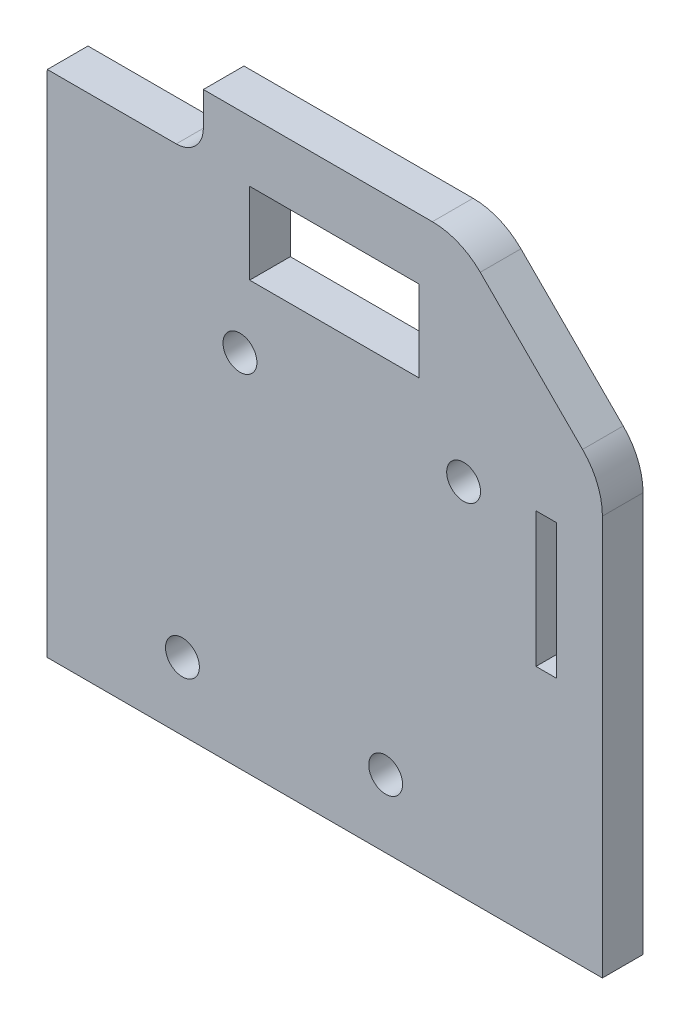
ISO-10303-21;
HEADER;
FILE_DESCRIPTION(('STEP AP214'),'2;1');
FILE_NAME('part.step','',(''),(''),'','','');
FILE_SCHEMA(('AUTOMOTIVE_DESIGN { 1 0 10303 214 1 1 1 1 }'));
ENDSEC;
DATA;
#1=APPLICATION_CONTEXT('core data for automotive mechanical design processes');
#2=APPLICATION_PROTOCOL_DEFINITION('international standard','automotive_design',2000,#1);
#3=PRODUCT_CONTEXT('',#1,'mechanical');
#4=PRODUCT('Part','Part','',(#3));
#5=PRODUCT_RELATED_PRODUCT_CATEGORY('part','',(#4));
#6=PRODUCT_DEFINITION_FORMATION('','',#4);
#7=PRODUCT_DEFINITION_CONTEXT('part definition',#1,'design');
#8=PRODUCT_DEFINITION('design','',#6,#7);
#9=PRODUCT_DEFINITION_SHAPE('','',#8);
#10=(LENGTH_UNIT() NAMED_UNIT(*) SI_UNIT(.MILLI.,.METRE.));
#11=(NAMED_UNIT(*) PLANE_ANGLE_UNIT() SI_UNIT($,.RADIAN.));
#12=(NAMED_UNIT(*) SI_UNIT($,.STERADIAN.) SOLID_ANGLE_UNIT());
#13=UNCERTAINTY_MEASURE_WITH_UNIT(LENGTH_MEASURE(1.E-05),#10,'distance_accuracy_value','');
#14=(GEOMETRIC_REPRESENTATION_CONTEXT(3) GLOBAL_UNCERTAINTY_ASSIGNED_CONTEXT((#13)) GLOBAL_UNIT_ASSIGNED_CONTEXT((#10,
#11,#12)) REPRESENTATION_CONTEXT('',''));
#15=CARTESIAN_POINT('',(0.,0.,0.));
#16=DIRECTION('',(0.,0.,1.));
#17=DIRECTION('',(1.,0.,0.));
#18=AXIS2_PLACEMENT_3D('',#15,#16,#17);
#19=CARTESIAN_POINT('',(-261.973046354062,66.8435005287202,6.));
#20=DIRECTION('',(0.,0.,1.));
#21=DIRECTION('',(1.,0.,0.));
#22=AXIS2_PLACEMENT_3D('',#19,#20,#21);
#23=PLANE('',#22);
#24=DIRECTION('',(0.,1.,0.));
#25=VECTOR('',#24,1.);
#26=CARTESIAN_POINT('',(-248.88538149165,71.884414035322,6.));
#27=LINE('',#26,#25);
#28=CARTESIAN_POINT('',(-248.88538149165,71.884414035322,6.));
#29=VERTEX_POINT('',#28);
#30=CARTESIAN_POINT('',(-248.88538149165,76.8435005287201,6.));
#31=VERTEX_POINT('',#30);
#32=EDGE_CURVE('E47',#29,#31,#27,.T.);
#33=ORIENTED_EDGE('',*,*,#32,.F.);
#34=CARTESIAN_POINT('',(-252.88538149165,71.884414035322,6.));
#35=DIRECTION('',(0.,0.,1.));
#36=DIRECTION('',(1.,0.,0.));
#37=AXIS2_PLACEMENT_3D('',#34,#35,#36);
#38=CIRCLE('',#37,4.);
#39=CARTESIAN_POINT('',(-252.88538149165,67.884414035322,6.));
#40=VERTEX_POINT('',#39);
#41=EDGE_CURVE('E168',#40,#29,#38,.T.);
#42=ORIENTED_EDGE('',*,*,#41,.F.);
#43=DIRECTION('',(1.,0.,0.));
#44=VECTOR('',#43,1.);
#45=CARTESIAN_POINT('',(-271.973035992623,67.884414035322,6.));
#46=LINE('',#45,#44);
#47=CARTESIAN_POINT('',(-271.918723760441,67.884414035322,6.));
#48=VERTEX_POINT('',#47);
#49=EDGE_CURVE('E174',#48,#40,#46,.T.);
#50=ORIENTED_EDGE('',*,*,#49,.F.);
#51=CARTESIAN_POINT('',(-261.973046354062,66.8435005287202,6.));
#52=DIRECTION('',(0.,0.,1.));
#53=DIRECTION('',(1.,0.,0.));
#54=AXIS2_PLACEMENT_3D('',#51,#52,#53);
#55=CIRCLE('',#54,9.99999999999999);
#56=CARTESIAN_POINT('',(-271.97304635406,66.8435061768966,6.));
#57=VERTEX_POINT('',#56);
#58=EDGE_CURVE('E277',#48,#57,#55,.T.);
#59=ORIENTED_EDGE('',*,*,#58,.T.);
#60=DIRECTION('',(-5.64817653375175E-07,-0.999999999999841,0.));
#61=VECTOR('',#60,1.);
#62=CARTESIAN_POINT('',(-271.97304635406,66.8435061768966,6.));
#63=LINE('',#62,#61);
#64=CARTESIAN_POINT('',(-271.973088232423,-7.30141962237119,6.));
#65=VERTEX_POINT('',#64);
#66=EDGE_CURVE('E279',#57,#65,#63,.T.);
#67=ORIENTED_EDGE('',*,*,#66,.T.);
#68=DIRECTION('',(1.,0.,0.));
#69=VECTOR('',#68,1.);
#70=CARTESIAN_POINT('',(-189.97306501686,-7.30141962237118,6.));
#71=LINE('',#70,#69);
#72=CARTESIAN_POINT('',(-189.97306501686,-7.30141962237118,6.));
#73=VERTEX_POINT('',#72);
#74=EDGE_CURVE('E282',#65,#73,#71,.T.);
#75=ORIENTED_EDGE('',*,*,#74,.T.);
#76=DIRECTION('',(0.,1.,0.));
#77=VECTOR('',#76,1.);
#78=CARTESIAN_POINT('',(-189.97306501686,51.7422784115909,6.));
#79=LINE('',#78,#77);
#80=CARTESIAN_POINT('',(-189.97306501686,51.7422784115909,6.));
#81=VERTEX_POINT('',#80);
#82=EDGE_CURVE('E284',#73,#81,#79,.T.);
#83=ORIENTED_EDGE('',*,*,#82,.T.);
#84=CARTESIAN_POINT('',(-199.97306501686,51.7422784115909,6.));
#85=DIRECTION('',(0.,0.,1.));
#86=DIRECTION('',(1.,0.,0.));
#87=AXIS2_PLACEMENT_3D('',#84,#85,#86);
#88=CIRCLE('',#87,10.);
#89=CARTESIAN_POINT('',(-192.901997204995,58.8133462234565,6.));
#90=VERTEX_POINT('',#89);
#91=EDGE_CURVE('E286',#81,#90,#88,.T.);
#92=ORIENTED_EDGE('',*,*,#91,.T.);
#93=DIRECTION('',(-0.707106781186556,0.707106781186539,0.));
#94=VECTOR('',#93,1.);
#95=CARTESIAN_POINT('',(-192.901997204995,58.8133462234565,6.));
#96=LINE('',#95,#94);
#97=CARTESIAN_POINT('',(-208.003219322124,73.9145683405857,6.));
#98=VERTEX_POINT('',#97);
#99=EDGE_CURVE('E288',#90,#98,#96,.T.);
#100=ORIENTED_EDGE('',*,*,#99,.T.);
#101=CARTESIAN_POINT('',(-215.07428713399,66.8435005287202,6.));
#102=DIRECTION('',(0.,0.,1.));
#103=DIRECTION('',(1.,0.,0.));
#104=AXIS2_PLACEMENT_3D('',#101,#102,#103);
#105=CIRCLE('',#104,9.99999999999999);
#106=CARTESIAN_POINT('',(-215.07428713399,76.8435005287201,6.));
#107=VERTEX_POINT('',#106);
#108=EDGE_CURVE('E290',#98,#107,#105,.T.);
#109=ORIENTED_EDGE('',*,*,#108,.T.);
#110=DIRECTION('',(-1.,0.,0.));
#111=VECTOR('',#110,1.);
#112=CARTESIAN_POINT('',(-261.973046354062,76.8435005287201,6.));
#113=LINE('',#112,#111);
#114=EDGE_CURVE('E292',#107,#31,#113,.T.);
#115=ORIENTED_EDGE('',*,*,#114,.T.);
#116=EDGE_LOOP('',(#33,#42,#50,#59,#67,#75,#83,#92,#100,#109,#115));
#117=FACE_BOUND('',#116,.T.);
#118=DIRECTION('',(0.,1.,0.));
#119=VECTOR('',#118,1.);
#120=CARTESIAN_POINT('',(-199.780083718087,27.6308045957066,6.));
#121=LINE('',#120,#119);
#122=CARTESIAN_POINT('',(-199.780083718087,27.6308045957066,6.));
#123=VERTEX_POINT('',#122);
#124=CARTESIAN_POINT('',(-199.780083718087,47.5294663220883,6.));
#125=VERTEX_POINT('',#124);
#126=EDGE_CURVE('E192',#123,#125,#121,.T.);
#127=ORIENTED_EDGE('',*,*,#126,.T.);
#128=DIRECTION('',(1.,0.,0.));
#129=VECTOR('',#128,1.);
#130=CARTESIAN_POINT('',(-196.780083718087,47.5294663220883,6.));
#131=LINE('',#130,#129);
#132=CARTESIAN_POINT('',(-196.780083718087,47.5294663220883,6.));
#133=VERTEX_POINT('',#132);
#134=EDGE_CURVE('E195',#125,#133,#131,.T.);
#135=ORIENTED_EDGE('',*,*,#134,.T.);
#136=DIRECTION('',(0.,-1.,0.));
#137=VECTOR('',#136,1.);
#138=CARTESIAN_POINT('',(-196.780083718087,27.6308045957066,6.));
#139=LINE('',#138,#137);
#140=CARTESIAN_POINT('',(-196.780083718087,27.6308045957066,6.));
#141=VERTEX_POINT('',#140);
#142=EDGE_CURVE('E55',#133,#141,#139,.T.);
#143=ORIENTED_EDGE('',*,*,#142,.T.);
#144=DIRECTION('',(-1.,0.,0.));
#145=VECTOR('',#144,1.);
#146=CARTESIAN_POINT('',(-196.780083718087,27.6308045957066,6.));
#147=LINE('',#146,#145);
#148=EDGE_CURVE('E200',#141,#123,#147,.T.);
#149=ORIENTED_EDGE('',*,*,#148,.T.);
#150=EDGE_LOOP('',(#127,#135,#143,#149));
#151=FACE_BOUND('',#150,.T.);
#152=CARTESIAN_POINT('',(-243.482374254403,45.8964952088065,6.));
#153=DIRECTION('',(0.,0.,1.));
#154=DIRECTION('',(1.,0.,0.));
#155=AXIS2_PLACEMENT_3D('',#152,#153,#154);
#156=CIRCLE('',#155,2.49999999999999);
#157=CARTESIAN_POINT('',(-240.982374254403,45.8964952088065,6.));
#158=VERTEX_POINT('',#157);
#159=EDGE_CURVE('E228',#158,#158,#156,.T.);
#160=ORIENTED_EDGE('',*,*,#159,.F.);
#161=EDGE_LOOP('',(#160));
#162=FACE_BOUND('',#161,.T.);
#163=CARTESIAN_POINT('',(-251.97306501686,2.69858037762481,6.));
#164=DIRECTION('',(0.,0.,1.));
#165=DIRECTION('',(1.,0.,0.));
#166=AXIS2_PLACEMENT_3D('',#163,#164,#165);
#167=CIRCLE('',#166,2.49999999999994);
#168=CARTESIAN_POINT('',(-249.473065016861,2.69858037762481,6.));
#169=VERTEX_POINT('',#168);
#170=EDGE_CURVE('E240',#169,#169,#167,.T.);
#171=ORIENTED_EDGE('',*,*,#170,.F.);
#172=EDGE_LOOP('',(#171));
#173=FACE_BOUND('',#172,.T.);
#174=DIRECTION('',(1.,0.,0.));
#175=VECTOR('',#174,1.);
#176=CARTESIAN_POINT('',(-217.046614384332,55.8844140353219,6.));
#177=LINE('',#176,#175);
#178=CARTESIAN_POINT('',(-242.046605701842,55.8844140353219,6.));
#179=VERTEX_POINT('',#178);
#180=CARTESIAN_POINT('',(-217.046614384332,55.8844140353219,6.));
#181=VERTEX_POINT('',#180);
#182=EDGE_CURVE('E248',#179,#181,#177,.T.);
#183=ORIENTED_EDGE('',*,*,#182,.F.);
#184=DIRECTION('',(0.,-1.,0.));
#185=VECTOR('',#184,1.);
#186=CARTESIAN_POINT('',(-242.046605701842,55.8844140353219,6.));
#187=LINE('',#186,#185);
#188=CARTESIAN_POINT('',(-242.046605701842,67.8844140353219,6.));
#189=VERTEX_POINT('',#188);
#190=EDGE_CURVE('E246',#189,#179,#187,.T.);
#191=ORIENTED_EDGE('',*,*,#190,.F.);
#192=DIRECTION('',(-1.,0.,0.));
#193=VECTOR('',#192,1.);
#194=CARTESIAN_POINT('',(-242.046605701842,67.8844140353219,6.));
#195=LINE('',#194,#193);
#196=CARTESIAN_POINT('',(-217.046614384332,67.8844140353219,6.));
#197=VERTEX_POINT('',#196);
#198=EDGE_CURVE('E254',#197,#189,#195,.T.);
#199=ORIENTED_EDGE('',*,*,#198,.F.);
#200=DIRECTION('',(0.,1.,0.));
#201=VECTOR('',#200,1.);
#202=CARTESIAN_POINT('',(-217.046614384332,67.8844140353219,6.));
#203=LINE('',#202,#201);
#204=EDGE_CURVE('E251',#181,#197,#203,.T.);
#205=ORIENTED_EDGE('',*,*,#204,.F.);
#206=EDGE_LOOP('',(#183,#191,#199,#205));
#207=FACE_BOUND('',#206,.T.);
#208=CARTESIAN_POINT('',(-221.971337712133,2.69858037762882,6.));
#209=DIRECTION('',(0.,0.,1.));
#210=DIRECTION('',(1.,0.,0.));
#211=AXIS2_PLACEMENT_3D('',#208,#209,#210);
#212=CIRCLE('',#211,2.49824947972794);
#213=CARTESIAN_POINT('',(-219.473088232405,2.69858037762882,6.));
#214=VERTEX_POINT('',#213);
#215=EDGE_CURVE('E234',#214,#214,#212,.T.);
#216=ORIENTED_EDGE('',*,*,#215,.F.);
#217=EDGE_LOOP('',(#216));
#218=FACE_BOUND('',#217,.T.);
#219=CARTESIAN_POINT('',(-210.463802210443,45.8964952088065,6.));
#220=DIRECTION('',(0.,0.,1.));
#221=DIRECTION('',(1.,0.,0.));
#222=AXIS2_PLACEMENT_3D('',#219,#220,#221);
#223=CIRCLE('',#222,2.5);
#224=CARTESIAN_POINT('',(-207.963802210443,45.8964952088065,6.));
#225=VERTEX_POINT('',#224);
#226=EDGE_CURVE('E222',#225,#225,#223,.T.);
#227=ORIENTED_EDGE('',*,*,#226,.F.);
#228=EDGE_LOOP('',(#227));
#229=FACE_BOUND('',#228,.T.);
#230=ADVANCED_FACE('F32',(#117,#151,#162,#173,#207,#218,#229),#23,.T.);
#231=CARTESIAN_POINT('',(-261.973046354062,66.8435005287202,0.));
#232=DIRECTION('',(0.,0.,1.));
#233=DIRECTION('',(1.,0.,0.));
#234=AXIS2_PLACEMENT_3D('',#231,#232,#233);
#235=PLANE('',#234);
#236=DIRECTION('',(1.,0.,0.));
#237=VECTOR('',#236,1.);
#238=CARTESIAN_POINT('',(-196.780083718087,47.5294663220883,0.));
#239=LINE('',#238,#237);
#240=CARTESIAN_POINT('',(-199.780083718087,47.5294663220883,0.));
#241=VERTEX_POINT('',#240);
#242=CARTESIAN_POINT('',(-196.780083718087,47.5294663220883,0.));
#243=VERTEX_POINT('',#242);
#244=EDGE_CURVE('E205',#241,#243,#239,.T.);
#245=ORIENTED_EDGE('',*,*,#244,.F.);
#246=DIRECTION('',(0.,1.,0.));
#247=VECTOR('',#246,1.);
#248=CARTESIAN_POINT('',(-199.780083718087,27.6308045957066,0.));
#249=LINE('',#248,#247);
#250=CARTESIAN_POINT('',(-199.780083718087,27.6308045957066,0.));
#251=VERTEX_POINT('',#250);
#252=EDGE_CURVE('E191',#251,#241,#249,.T.);
#253=ORIENTED_EDGE('',*,*,#252,.F.);
#254=DIRECTION('',(-1.,0.,0.));
#255=VECTOR('',#254,1.);
#256=CARTESIAN_POINT('',(-196.780083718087,27.6308045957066,0.));
#257=LINE('',#256,#255);
#258=CARTESIAN_POINT('',(-196.780083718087,27.6308045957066,0.));
#259=VERTEX_POINT('',#258);
#260=EDGE_CURVE('E196',#259,#251,#257,.T.);
#261=ORIENTED_EDGE('',*,*,#260,.F.);
#262=DIRECTION('',(0.,-1.,0.));
#263=VECTOR('',#262,1.);
#264=CARTESIAN_POINT('',(-196.780083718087,27.6308045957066,0.));
#265=LINE('',#264,#263);
#266=EDGE_CURVE('E208',#243,#259,#265,.T.);
#267=ORIENTED_EDGE('',*,*,#266,.F.);
#268=EDGE_LOOP('',(#245,#253,#261,#267));
#269=FACE_BOUND('',#268,.T.);
#270=CARTESIAN_POINT('',(-243.482374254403,45.8964952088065,0.));
#271=DIRECTION('',(0.,0.,1.));
#272=DIRECTION('',(1.,0.,0.));
#273=AXIS2_PLACEMENT_3D('',#270,#271,#272);
#274=CIRCLE('',#273,2.49999999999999);
#275=CARTESIAN_POINT('',(-240.982374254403,45.8964952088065,0.));
#276=VERTEX_POINT('',#275);
#277=EDGE_CURVE('E225',#276,#276,#274,.T.);
#278=ORIENTED_EDGE('',*,*,#277,.T.);
#279=EDGE_LOOP('',(#278));
#280=FACE_BOUND('',#279,.T.);
#281=CARTESIAN_POINT('',(-251.97306501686,2.69858037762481,0.));
#282=DIRECTION('',(0.,0.,1.));
#283=DIRECTION('',(1.,0.,0.));
#284=AXIS2_PLACEMENT_3D('',#281,#282,#283);
#285=CIRCLE('',#284,2.49999999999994);
#286=CARTESIAN_POINT('',(-249.473065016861,2.69858037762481,0.));
#287=VERTEX_POINT('',#286);
#288=EDGE_CURVE('E237',#287,#287,#285,.T.);
#289=ORIENTED_EDGE('',*,*,#288,.T.);
#290=EDGE_LOOP('',(#289));
#291=FACE_BOUND('',#290,.T.);
#292=CARTESIAN_POINT('',(-252.88538149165,71.884414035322,0.));
#293=DIRECTION('',(0.,0.,1.));
#294=DIRECTION('',(1.,0.,0.));
#295=AXIS2_PLACEMENT_3D('',#292,#293,#294);
#296=CIRCLE('',#295,4.);
#297=CARTESIAN_POINT('',(-252.88538149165,67.884414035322,0.));
#298=VERTEX_POINT('',#297);
#299=CARTESIAN_POINT('',(-248.88538149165,71.884414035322,0.));
#300=VERTEX_POINT('',#299);
#301=EDGE_CURVE('E11',#298,#300,#296,.T.);
#302=ORIENTED_EDGE('',*,*,#301,.T.);
#303=DIRECTION('',(0.,1.,0.));
#304=VECTOR('',#303,1.);
#305=CARTESIAN_POINT('',(-248.88538149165,66.8435005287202,0.));
#306=LINE('',#305,#304);
#307=CARTESIAN_POINT('',(-248.88538149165,76.8435005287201,0.));
#308=VERTEX_POINT('',#307);
#309=EDGE_CURVE('E185',#300,#308,#306,.T.);
#310=ORIENTED_EDGE('',*,*,#309,.T.);
#311=DIRECTION('',(-1.,0.,0.));
#312=VECTOR('',#311,1.);
#313=CARTESIAN_POINT('',(-261.973046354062,76.8435005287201,0.));
#314=LINE('',#313,#312);
#315=CARTESIAN_POINT('',(-215.07428713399,76.8435005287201,0.));
#316=VERTEX_POINT('',#315);
#317=EDGE_CURVE('E280',#316,#308,#314,.T.);
#318=ORIENTED_EDGE('',*,*,#317,.F.);
#319=CARTESIAN_POINT('',(-215.07428713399,66.8435005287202,0.));
#320=DIRECTION('',(0.,0.,1.));
#321=DIRECTION('',(1.,0.,0.));
#322=AXIS2_PLACEMENT_3D('',#319,#320,#321);
#323=CIRCLE('',#322,9.99999999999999);
#324=CARTESIAN_POINT('',(-208.003219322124,73.9145683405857,0.));
#325=VERTEX_POINT('',#324);
#326=EDGE_CURVE('E306',#325,#316,#323,.T.);
#327=ORIENTED_EDGE('',*,*,#326,.F.);
#328=DIRECTION('',(-0.707106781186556,0.707106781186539,0.));
#329=VECTOR('',#328,1.);
#330=CARTESIAN_POINT('',(-192.901997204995,58.8133462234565,0.));
#331=LINE('',#330,#329);
#332=CARTESIAN_POINT('',(-192.901997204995,58.8133462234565,0.));
#333=VERTEX_POINT('',#332);
#334=EDGE_CURVE('E304',#333,#325,#331,.T.);
#335=ORIENTED_EDGE('',*,*,#334,.F.);
#336=CARTESIAN_POINT('',(-199.97306501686,51.7422784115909,0.));
#337=DIRECTION('',(0.,0.,1.));
#338=DIRECTION('',(1.,0.,0.));
#339=AXIS2_PLACEMENT_3D('',#336,#337,#338);
#340=CIRCLE('',#339,10.);
#341=CARTESIAN_POINT('',(-189.97306501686,51.7422784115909,0.));
#342=VERTEX_POINT('',#341);
#343=EDGE_CURVE('E302',#342,#333,#340,.T.);
#344=ORIENTED_EDGE('',*,*,#343,.F.);
#345=DIRECTION('',(0.,1.,0.));
#346=VECTOR('',#345,1.);
#347=CARTESIAN_POINT('',(-189.97306501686,51.7422784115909,0.));
#348=LINE('',#347,#346);
#349=CARTESIAN_POINT('',(-189.97306501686,-7.30141962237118,0.));
#350=VERTEX_POINT('',#349);
#351=EDGE_CURVE('E300',#350,#342,#348,.T.);
#352=ORIENTED_EDGE('',*,*,#351,.F.);
#353=DIRECTION('',(1.,0.,0.));
#354=VECTOR('',#353,1.);
#355=CARTESIAN_POINT('',(-189.97306501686,-7.30141962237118,0.));
#356=LINE('',#355,#354);
#357=CARTESIAN_POINT('',(-271.973088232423,-7.30141962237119,0.));
#358=VERTEX_POINT('',#357);
#359=EDGE_CURVE('E298',#358,#350,#356,.T.);
#360=ORIENTED_EDGE('',*,*,#359,.F.);
#361=DIRECTION('',(-5.64817653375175E-07,-0.999999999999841,0.));
#362=VECTOR('',#361,1.);
#363=CARTESIAN_POINT('',(-271.97304635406,66.8435061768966,0.));
#364=LINE('',#363,#362);
#365=CARTESIAN_POINT('',(-271.97304635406,66.8435061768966,0.));
#366=VERTEX_POINT('',#365);
#367=EDGE_CURVE('E296',#366,#358,#364,.T.);
#368=ORIENTED_EDGE('',*,*,#367,.F.);
#369=CARTESIAN_POINT('',(-261.973046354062,66.8435005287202,0.));
#370=DIRECTION('',(0.,0.,1.));
#371=DIRECTION('',(1.,0.,0.));
#372=AXIS2_PLACEMENT_3D('',#369,#370,#371);
#373=CIRCLE('',#372,9.99999999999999);
#374=CARTESIAN_POINT('',(-271.918723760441,67.884414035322,0.));
#375=VERTEX_POINT('',#374);
#376=EDGE_CURVE('E276',#375,#366,#373,.T.);
#377=ORIENTED_EDGE('',*,*,#376,.F.);
#378=DIRECTION('',(1.,0.,0.));
#379=VECTOR('',#378,1.);
#380=CARTESIAN_POINT('',(-261.973046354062,67.884414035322,0.));
#381=LINE('',#380,#379);
#382=EDGE_CURVE('E189',#375,#298,#381,.T.);
#383=ORIENTED_EDGE('',*,*,#382,.T.);
#384=EDGE_LOOP('',(#302,#310,#318,#327,#335,#344,#352,#360,#368,#377,#383));
#385=FACE_BOUND('',#384,.T.);
#386=DIRECTION('',(0.,-1.,0.));
#387=VECTOR('',#386,1.);
#388=CARTESIAN_POINT('',(-242.046605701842,55.8844140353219,0.));
#389=LINE('',#388,#387);
#390=CARTESIAN_POINT('',(-242.046605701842,67.8844140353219,0.));
#391=VERTEX_POINT('',#390);
#392=CARTESIAN_POINT('',(-242.046605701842,55.8844140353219,0.));
#393=VERTEX_POINT('',#392);
#394=EDGE_CURVE('E243',#391,#393,#389,.T.);
#395=ORIENTED_EDGE('',*,*,#394,.T.);
#396=DIRECTION('',(1.,0.,0.));
#397=VECTOR('',#396,1.);
#398=CARTESIAN_POINT('',(-217.046614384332,55.8844140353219,0.));
#399=LINE('',#398,#397);
#400=CARTESIAN_POINT('',(-217.046614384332,55.8844140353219,0.));
#401=VERTEX_POINT('',#400);
#402=EDGE_CURVE('E259',#393,#401,#399,.T.);
#403=ORIENTED_EDGE('',*,*,#402,.T.);
#404=DIRECTION('',(0.,1.,0.));
#405=VECTOR('',#404,1.);
#406=CARTESIAN_POINT('',(-217.046614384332,67.8844140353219,0.));
#407=LINE('',#406,#405);
#408=CARTESIAN_POINT('',(-217.046614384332,67.8844140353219,0.));
#409=VERTEX_POINT('',#408);
#410=EDGE_CURVE('E262',#401,#409,#407,.T.);
#411=ORIENTED_EDGE('',*,*,#410,.T.);
#412=DIRECTION('',(-1.,0.,0.));
#413=VECTOR('',#412,1.);
#414=CARTESIAN_POINT('',(-242.046605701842,67.8844140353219,0.));
#415=LINE('',#414,#413);
#416=EDGE_CURVE('E249',#409,#391,#415,.T.);
#417=ORIENTED_EDGE('',*,*,#416,.T.);
#418=EDGE_LOOP('',(#395,#403,#411,#417));
#419=FACE_BOUND('',#418,.T.);
#420=CARTESIAN_POINT('',(-221.971337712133,2.69858037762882,0.));
#421=DIRECTION('',(0.,0.,1.));
#422=DIRECTION('',(1.,0.,0.));
#423=AXIS2_PLACEMENT_3D('',#420,#421,#422);
#424=CIRCLE('',#423,2.49824947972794);
#425=CARTESIAN_POINT('',(-219.473088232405,2.69858037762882,0.));
#426=VERTEX_POINT('',#425);
#427=EDGE_CURVE('E231',#426,#426,#424,.T.);
#428=ORIENTED_EDGE('',*,*,#427,.T.);
#429=EDGE_LOOP('',(#428));
#430=FACE_BOUND('',#429,.T.);
#431=CARTESIAN_POINT('',(-210.463802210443,45.8964952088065,0.));
#432=DIRECTION('',(0.,0.,1.));
#433=DIRECTION('',(1.,0.,0.));
#434=AXIS2_PLACEMENT_3D('',#431,#432,#433);
#435=CIRCLE('',#434,2.5);
#436=CARTESIAN_POINT('',(-207.963802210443,45.8964952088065,0.));
#437=VERTEX_POINT('',#436);
#438=EDGE_CURVE('E215',#437,#437,#435,.T.);
#439=ORIENTED_EDGE('',*,*,#438,.T.);
#440=EDGE_LOOP('',(#439));
#441=FACE_BOUND('',#440,.T.);
#442=ADVANCED_FACE('F336',(#269,#280,#291,#385,#419,#430,#441),#235,.F.);
#443=CARTESIAN_POINT('',(-261.973046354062,66.8435005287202,6.));
#444=DIRECTION('',(0.,0.,-1.));
#445=DIRECTION('',(-1.,0.,0.));
#446=AXIS2_PLACEMENT_3D('',#443,#444,#445);
#447=CYLINDRICAL_SURFACE('',#446,9.99999999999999);
#448=ORIENTED_EDGE('',*,*,#58,.F.);
#449=DIRECTION('',(0.,0.,-1.));
#450=VECTOR('',#449,1.);
#451=CARTESIAN_POINT('',(-271.918723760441,67.884414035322,6.));
#452=LINE('',#451,#450);
#453=EDGE_CURVE('E40',#48,#375,#452,.T.);
#454=ORIENTED_EDGE('',*,*,#453,.T.);
#455=ORIENTED_EDGE('',*,*,#376,.T.);
#456=DIRECTION('',(0.,0.,-1.));
#457=VECTOR('',#456,1.);
#458=CARTESIAN_POINT('',(-271.97304635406,66.8435061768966,6.));
#459=LINE('',#458,#457);
#460=EDGE_CURVE('E327',#57,#366,#459,.T.);
#461=ORIENTED_EDGE('',*,*,#460,.F.);
#462=EDGE_LOOP('',(#448,#454,#455,#461));
#463=FACE_BOUND('',#462,.T.);
#464=ADVANCED_FACE('F34',(#463),#447,.T.);
#465=CARTESIAN_POINT('',(-271.97304635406,66.8435061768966,6.));
#466=DIRECTION('',(0.99999999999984,-5.64817653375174E-07,0.));
#467=DIRECTION('',(5.64817653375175E-07,0.999999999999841,0.));
#468=AXIS2_PLACEMENT_3D('',#465,#466,#467);
#469=PLANE('',#468);
#470=ORIENTED_EDGE('',*,*,#367,.T.);
#471=DIRECTION('',(0.,0.,-1.));
#472=VECTOR('',#471,1.);
#473=CARTESIAN_POINT('',(-271.973088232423,-7.30141962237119,6.));
#474=LINE('',#473,#472);
#475=EDGE_CURVE('E324',#65,#358,#474,.T.);
#476=ORIENTED_EDGE('',*,*,#475,.F.);
#477=ORIENTED_EDGE('',*,*,#66,.F.);
#478=ORIENTED_EDGE('',*,*,#460,.T.);
#479=EDGE_LOOP('',(#470,#476,#477,#478));
#480=FACE_BOUND('',#479,.T.);
#481=ADVANCED_FACE('F343',(#480),#469,.F.);
#482=CARTESIAN_POINT('',(-189.97306501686,-7.30141962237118,6.));
#483=DIRECTION('',(0.,1.,0.));
#484=DIRECTION('',(-1.,0.,0.));
#485=AXIS2_PLACEMENT_3D('',#482,#483,#484);
#486=PLANE('',#485);
#487=ORIENTED_EDGE('',*,*,#359,.T.);
#488=DIRECTION('',(0.,0.,-1.));
#489=VECTOR('',#488,1.);
#490=CARTESIAN_POINT('',(-189.97306501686,-7.30141962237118,6.));
#491=LINE('',#490,#489);
#492=EDGE_CURVE('E321',#73,#350,#491,.T.);
#493=ORIENTED_EDGE('',*,*,#492,.F.);
#494=ORIENTED_EDGE('',*,*,#74,.F.);
#495=ORIENTED_EDGE('',*,*,#475,.T.);
#496=EDGE_LOOP('',(#487,#493,#494,#495));
#497=FACE_BOUND('',#496,.T.);
#498=ADVANCED_FACE('F349',(#497),#486,.F.);
#499=CARTESIAN_POINT('',(-189.97306501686,51.7422784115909,6.));
#500=DIRECTION('',(-1.,0.,0.));
#501=DIRECTION('',(0.,-1.,0.));
#502=AXIS2_PLACEMENT_3D('',#499,#500,#501);
#503=PLANE('',#502);
#504=ORIENTED_EDGE('',*,*,#351,.T.);
#505=DIRECTION('',(0.,0.,-1.));
#506=VECTOR('',#505,1.);
#507=CARTESIAN_POINT('',(-189.97306501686,51.7422784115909,6.));
#508=LINE('',#507,#506);
#509=EDGE_CURVE('E318',#81,#342,#508,.T.);
#510=ORIENTED_EDGE('',*,*,#509,.F.);
#511=ORIENTED_EDGE('',*,*,#82,.F.);
#512=ORIENTED_EDGE('',*,*,#492,.T.);
#513=EDGE_LOOP('',(#504,#510,#511,#512));
#514=FACE_BOUND('',#513,.T.);
#515=ADVANCED_FACE('F351',(#514),#503,.F.);
#516=CARTESIAN_POINT('',(-199.97306501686,51.7422784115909,6.));
#517=DIRECTION('',(0.,0.,-1.));
#518=DIRECTION('',(-1.,0.,0.));
#519=AXIS2_PLACEMENT_3D('',#516,#517,#518);
#520=CYLINDRICAL_SURFACE('',#519,10.);
#521=ORIENTED_EDGE('',*,*,#343,.T.);
#522=DIRECTION('',(0.,0.,-1.));
#523=VECTOR('',#522,1.);
#524=CARTESIAN_POINT('',(-192.901997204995,58.8133462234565,6.));
#525=LINE('',#524,#523);
#526=EDGE_CURVE('E315',#90,#333,#525,.T.);
#527=ORIENTED_EDGE('',*,*,#526,.F.);
#528=ORIENTED_EDGE('',*,*,#91,.F.);
#529=ORIENTED_EDGE('',*,*,#509,.T.);
#530=EDGE_LOOP('',(#521,#527,#528,#529));
#531=FACE_BOUND('',#530,.T.);
#532=ADVANCED_FACE('F356',(#531),#520,.T.);
#533=CARTESIAN_POINT('',(-192.901997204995,58.8133462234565,6.));
#534=DIRECTION('',(-0.707106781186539,-0.707106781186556,0.));
#535=DIRECTION('',(0.707106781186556,-0.707106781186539,0.));
#536=AXIS2_PLACEMENT_3D('',#533,#534,#535);
#537=PLANE('',#536);
#538=ORIENTED_EDGE('',*,*,#334,.T.);
#539=DIRECTION('',(0.,0.,-1.));
#540=VECTOR('',#539,1.);
#541=CARTESIAN_POINT('',(-208.003219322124,73.9145683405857,6.));
#542=LINE('',#541,#540);
#543=EDGE_CURVE('E312',#98,#325,#542,.T.);
#544=ORIENTED_EDGE('',*,*,#543,.F.);
#545=ORIENTED_EDGE('',*,*,#99,.F.);
#546=ORIENTED_EDGE('',*,*,#526,.T.);
#547=EDGE_LOOP('',(#538,#544,#545,#546));
#548=FACE_BOUND('',#547,.T.);
#549=ADVANCED_FACE('F362',(#548),#537,.F.);
#550=CARTESIAN_POINT('',(-215.07428713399,66.8435005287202,6.));
#551=DIRECTION('',(0.,0.,-1.));
#552=DIRECTION('',(-1.,0.,0.));
#553=AXIS2_PLACEMENT_3D('',#550,#551,#552);
#554=CYLINDRICAL_SURFACE('',#553,9.99999999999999);
#555=ORIENTED_EDGE('',*,*,#326,.T.);
#556=DIRECTION('',(0.,0.,-1.));
#557=VECTOR('',#556,1.);
#558=CARTESIAN_POINT('',(-215.07428713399,76.8435005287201,6.));
#559=LINE('',#558,#557);
#560=EDGE_CURVE('E294',#107,#316,#559,.T.);
#561=ORIENTED_EDGE('',*,*,#560,.F.);
#562=ORIENTED_EDGE('',*,*,#108,.F.);
#563=ORIENTED_EDGE('',*,*,#543,.T.);
#564=EDGE_LOOP('',(#555,#561,#562,#563));
#565=FACE_BOUND('',#564,.T.);
#566=ADVANCED_FACE('F366',(#565),#554,.T.);
#567=CARTESIAN_POINT('',(-261.973046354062,76.8435005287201,6.));
#568=DIRECTION('',(0.,-1.,0.));
#569=DIRECTION('',(0.,0.,-1.));
#570=AXIS2_PLACEMENT_3D('',#567,#568,#569);
#571=PLANE('',#570);
#572=ORIENTED_EDGE('',*,*,#317,.T.);
#573=DIRECTION('',(0.,0.,1.));
#574=VECTOR('',#573,1.);
#575=CARTESIAN_POINT('',(-248.88538149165,76.8435005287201,6.));
#576=LINE('',#575,#574);
#577=EDGE_CURVE('E330',#308,#31,#576,.T.);
#578=ORIENTED_EDGE('',*,*,#577,.T.);
#579=ORIENTED_EDGE('',*,*,#114,.F.);
#580=ORIENTED_EDGE('',*,*,#560,.T.);
#581=EDGE_LOOP('',(#572,#578,#579,#580));
#582=FACE_BOUND('',#581,.T.);
#583=ADVANCED_FACE('F370',(#582),#571,.F.);
#584=CARTESIAN_POINT('',(-242.046605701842,55.8844140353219,6.));
#585=DIRECTION('',(1.,0.,0.));
#586=DIRECTION('',(0.,0.,-1.));
#587=AXIS2_PLACEMENT_3D('',#584,#585,#586);
#588=PLANE('',#587);
#589=ORIENTED_EDGE('',*,*,#394,.F.);
#590=DIRECTION('',(0.,0.,-1.));
#591=VECTOR('',#590,1.);
#592=CARTESIAN_POINT('',(-242.046605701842,67.8844140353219,6.));
#593=LINE('',#592,#591);
#594=EDGE_CURVE('E256',#189,#391,#593,.T.);
#595=ORIENTED_EDGE('',*,*,#594,.F.);
#596=ORIENTED_EDGE('',*,*,#190,.T.);
#597=DIRECTION('',(0.,0.,-1.));
#598=VECTOR('',#597,1.);
#599=CARTESIAN_POINT('',(-242.046605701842,55.8844140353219,6.));
#600=LINE('',#599,#598);
#601=EDGE_CURVE('E273',#179,#393,#600,.T.);
#602=ORIENTED_EDGE('',*,*,#601,.T.);
#603=EDGE_LOOP('',(#589,#595,#596,#602));
#604=FACE_BOUND('',#603,.T.);
#605=ADVANCED_FACE('F387',(#604),#588,.T.);
#606=CARTESIAN_POINT('',(-217.046614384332,55.8844140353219,6.));
#607=DIRECTION('',(0.,1.,0.));
#608=DIRECTION('',(0.,0.,1.));
#609=AXIS2_PLACEMENT_3D('',#606,#607,#608);
#610=PLANE('',#609);
#611=ORIENTED_EDGE('',*,*,#402,.F.);
#612=ORIENTED_EDGE('',*,*,#601,.F.);
#613=ORIENTED_EDGE('',*,*,#182,.T.);
#614=DIRECTION('',(0.,0.,-1.));
#615=VECTOR('',#614,1.);
#616=CARTESIAN_POINT('',(-217.046614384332,55.8844140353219,6.));
#617=LINE('',#616,#615);
#618=EDGE_CURVE('E271',#181,#401,#617,.T.);
#619=ORIENTED_EDGE('',*,*,#618,.T.);
#620=EDGE_LOOP('',(#611,#612,#613,#619));
#621=FACE_BOUND('',#620,.T.);
#622=ADVANCED_FACE('F517',(#621),#610,.T.);
#623=CARTESIAN_POINT('',(-217.046614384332,67.8844140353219,6.));
#624=DIRECTION('',(-1.,0.,0.));
#625=DIRECTION('',(0.,0.,1.));
#626=AXIS2_PLACEMENT_3D('',#623,#624,#625);
#627=PLANE('',#626);
#628=ORIENTED_EDGE('',*,*,#410,.F.);
#629=ORIENTED_EDGE('',*,*,#618,.F.);
#630=ORIENTED_EDGE('',*,*,#204,.T.);
#631=DIRECTION('',(0.,0.,-1.));
#632=VECTOR('',#631,1.);
#633=CARTESIAN_POINT('',(-217.046614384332,67.8844140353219,6.));
#634=LINE('',#633,#632);
#635=EDGE_CURVE('E269',#197,#409,#634,.T.);
#636=ORIENTED_EDGE('',*,*,#635,.T.);
#637=EDGE_LOOP('',(#628,#629,#630,#636));
#638=FACE_BOUND('',#637,.T.);
#639=ADVANCED_FACE('F507',(#638),#627,.T.);
#640=CARTESIAN_POINT('',(-242.046605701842,67.8844140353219,6.));
#641=DIRECTION('',(0.,-1.,0.));
#642=DIRECTION('',(0.,0.,-1.));
#643=AXIS2_PLACEMENT_3D('',#640,#641,#642);
#644=PLANE('',#643);
#645=ORIENTED_EDGE('',*,*,#416,.F.);
#646=ORIENTED_EDGE('',*,*,#635,.F.);
#647=ORIENTED_EDGE('',*,*,#198,.T.);
#648=ORIENTED_EDGE('',*,*,#594,.T.);
#649=EDGE_LOOP('',(#645,#646,#647,#648));
#650=FACE_BOUND('',#649,.T.);
#651=ADVANCED_FACE('F497',(#650),#644,.T.);
#652=CARTESIAN_POINT('',(-251.97306501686,2.69858037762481,6.));
#653=DIRECTION('',(0.,0.,-1.));
#654=DIRECTION('',(-1.,0.,0.));
#655=AXIS2_PLACEMENT_3D('',#652,#653,#654);
#656=CYLINDRICAL_SURFACE('',#655,2.49999999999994);
#657=ORIENTED_EDGE('',*,*,#170,.T.);
#658=EDGE_LOOP('',(#657));
#659=FACE_BOUND('',#658,.T.);
#660=ORIENTED_EDGE('',*,*,#288,.F.);
#661=EDGE_LOOP('',(#660));
#662=FACE_BOUND('',#661,.T.);
#663=ADVANCED_FACE('F487',(#659,#662),#656,.F.);
#664=CARTESIAN_POINT('',(-221.971337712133,2.69858037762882,6.));
#665=DIRECTION('',(0.,0.,-1.));
#666=DIRECTION('',(-1.,0.,0.));
#667=AXIS2_PLACEMENT_3D('',#664,#665,#666);
#668=CYLINDRICAL_SURFACE('',#667,2.49824947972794);
#669=ORIENTED_EDGE('',*,*,#215,.T.);
#670=EDGE_LOOP('',(#669));
#671=FACE_BOUND('',#670,.T.);
#672=ORIENTED_EDGE('',*,*,#427,.F.);
#673=EDGE_LOOP('',(#672));
#674=FACE_BOUND('',#673,.T.);
#675=ADVANCED_FACE('F477',(#671,#674),#668,.F.);
#676=CARTESIAN_POINT('',(-243.482374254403,45.8964952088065,6.));
#677=DIRECTION('',(0.,0.,-1.));
#678=DIRECTION('',(-1.,0.,0.));
#679=AXIS2_PLACEMENT_3D('',#676,#677,#678);
#680=CYLINDRICAL_SURFACE('',#679,2.49999999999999);
#681=ORIENTED_EDGE('',*,*,#159,.T.);
#682=EDGE_LOOP('',(#681));
#683=FACE_BOUND('',#682,.T.);
#684=ORIENTED_EDGE('',*,*,#277,.F.);
#685=EDGE_LOOP('',(#684));
#686=FACE_BOUND('',#685,.T.);
#687=ADVANCED_FACE('F467',(#683,#686),#680,.F.);
#688=CARTESIAN_POINT('',(-210.463802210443,45.8964952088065,6.));
#689=DIRECTION('',(0.,0.,-1.));
#690=DIRECTION('',(-1.,0.,0.));
#691=AXIS2_PLACEMENT_3D('',#688,#689,#690);
#692=CYLINDRICAL_SURFACE('',#691,2.5);
#693=ORIENTED_EDGE('',*,*,#226,.T.);
#694=EDGE_LOOP('',(#693));
#695=FACE_BOUND('',#694,.T.);
#696=ORIENTED_EDGE('',*,*,#438,.F.);
#697=EDGE_LOOP('',(#696));
#698=FACE_BOUND('',#697,.T.);
#699=ADVANCED_FACE('F457',(#695,#698),#692,.F.);
#700=CARTESIAN_POINT('',(-199.780083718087,27.6308045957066,6.));
#701=DIRECTION('',(-1.,0.,0.));
#702=DIRECTION('',(0.,0.,1.));
#703=AXIS2_PLACEMENT_3D('',#700,#701,#702);
#704=PLANE('',#703);
#705=ORIENTED_EDGE('',*,*,#252,.T.);
#706=DIRECTION('',(0.,0.,-1.));
#707=VECTOR('',#706,1.);
#708=CARTESIAN_POINT('',(-199.780083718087,47.5294663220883,6.));
#709=LINE('',#708,#707);
#710=EDGE_CURVE('E203',#125,#241,#709,.T.);
#711=ORIENTED_EDGE('',*,*,#710,.F.);
#712=ORIENTED_EDGE('',*,*,#126,.F.);
#713=DIRECTION('',(0.,0.,-1.));
#714=VECTOR('',#713,1.);
#715=CARTESIAN_POINT('',(-199.780083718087,27.6308045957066,6.));
#716=LINE('',#715,#714);
#717=EDGE_CURVE('E213',#123,#251,#716,.T.);
#718=ORIENTED_EDGE('',*,*,#717,.T.);
#719=EDGE_LOOP('',(#705,#711,#712,#718));
#720=FACE_BOUND('',#719,.T.);
#721=ADVANCED_FACE('F447',(#720),#704,.F.);
#722=CARTESIAN_POINT('',(-196.780083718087,27.6308045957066,6.));
#723=DIRECTION('',(0.,-1.,0.));
#724=DIRECTION('',(0.,0.,-1.));
#725=AXIS2_PLACEMENT_3D('',#722,#723,#724);
#726=PLANE('',#725);
#727=ORIENTED_EDGE('',*,*,#260,.T.);
#728=ORIENTED_EDGE('',*,*,#717,.F.);
#729=ORIENTED_EDGE('',*,*,#148,.F.);
#730=DIRECTION('',(0.,0.,-1.));
#731=VECTOR('',#730,1.);
#732=CARTESIAN_POINT('',(-196.780083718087,27.6308045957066,6.));
#733=LINE('',#732,#731);
#734=EDGE_CURVE('E216',#141,#259,#733,.T.);
#735=ORIENTED_EDGE('',*,*,#734,.T.);
#736=EDGE_LOOP('',(#727,#728,#729,#735));
#737=FACE_BOUND('',#736,.T.);
#738=ADVANCED_FACE('F438',(#737),#726,.F.);
#739=CARTESIAN_POINT('',(-196.780083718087,27.6308045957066,6.));
#740=DIRECTION('',(1.,0.,0.));
#741=DIRECTION('',(0.,0.,-1.));
#742=AXIS2_PLACEMENT_3D('',#739,#740,#741);
#743=PLANE('',#742);
#744=ORIENTED_EDGE('',*,*,#266,.T.);
#745=ORIENTED_EDGE('',*,*,#734,.F.);
#746=ORIENTED_EDGE('',*,*,#142,.F.);
#747=DIRECTION('',(0.,0.,-1.));
#748=VECTOR('',#747,1.);
#749=CARTESIAN_POINT('',(-196.780083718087,47.5294663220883,6.));
#750=LINE('',#749,#748);
#751=EDGE_CURVE('E218',#133,#243,#750,.T.);
#752=ORIENTED_EDGE('',*,*,#751,.T.);
#753=EDGE_LOOP('',(#744,#745,#746,#752));
#754=FACE_BOUND('',#753,.T.);
#755=ADVANCED_FACE('F426',(#754),#743,.F.);
#756=CARTESIAN_POINT('',(-196.780083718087,47.5294663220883,6.));
#757=DIRECTION('',(0.,1.,0.));
#758=DIRECTION('',(0.,0.,1.));
#759=AXIS2_PLACEMENT_3D('',#756,#757,#758);
#760=PLANE('',#759);
#761=ORIENTED_EDGE('',*,*,#244,.T.);
#762=ORIENTED_EDGE('',*,*,#751,.F.);
#763=ORIENTED_EDGE('',*,*,#134,.F.);
#764=ORIENTED_EDGE('',*,*,#710,.T.);
#765=EDGE_LOOP('',(#761,#762,#763,#764));
#766=FACE_BOUND('',#765,.T.);
#767=ADVANCED_FACE('F421',(#766),#760,.F.);
#768=CARTESIAN_POINT('',(-252.88538149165,71.884414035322,-4.));
#769=DIRECTION('',(0.,0.,1.));
#770=DIRECTION('',(1.,0.,0.));
#771=AXIS2_PLACEMENT_3D('',#768,#769,#770);
#772=CYLINDRICAL_SURFACE('',#771,4.);
#773=DIRECTION('',(0.,0.,1.));
#774=VECTOR('',#773,1.);
#775=CARTESIAN_POINT('',(-252.88538149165,67.884414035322,-4.));
#776=LINE('',#775,#774);
#777=EDGE_CURVE('E163',#298,#40,#776,.T.);
#778=ORIENTED_EDGE('',*,*,#777,.T.);
#779=ORIENTED_EDGE('',*,*,#41,.T.);
#780=DIRECTION('',(0.,0.,1.));
#781=VECTOR('',#780,1.);
#782=CARTESIAN_POINT('',(-248.88538149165,71.884414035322,-4.));
#783=LINE('',#782,#781);
#784=EDGE_CURVE('E171',#300,#29,#783,.T.);
#785=ORIENTED_EDGE('',*,*,#784,.F.);
#786=ORIENTED_EDGE('',*,*,#301,.F.);
#787=EDGE_LOOP('',(#778,#779,#785,#786));
#788=FACE_BOUND('',#787,.T.);
#789=ADVANCED_FACE('F165',(#788),#772,.F.);
#790=CARTESIAN_POINT('',(-271.973035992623,67.884414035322,-4.));
#791=DIRECTION('',(0.,-1.,0.));
#792=DIRECTION('',(0.,0.,-1.));
#793=AXIS2_PLACEMENT_3D('',#790,#791,#792);
#794=PLANE('',#793);
#795=ORIENTED_EDGE('',*,*,#453,.F.);
#796=ORIENTED_EDGE('',*,*,#49,.T.);
#797=ORIENTED_EDGE('',*,*,#777,.F.);
#798=ORIENTED_EDGE('',*,*,#382,.F.);
#799=EDGE_LOOP('',(#795,#796,#797,#798));
#800=FACE_BOUND('',#799,.T.);
#801=ADVANCED_FACE('F175',(#800),#794,.F.);
#802=CARTESIAN_POINT('',(-248.88538149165,71.884414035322,-4.));
#803=DIRECTION('',(1.,0.,0.));
#804=DIRECTION('',(0.,0.,-1.));
#805=AXIS2_PLACEMENT_3D('',#802,#803,#804);
#806=PLANE('',#805);
#807=ORIENTED_EDGE('',*,*,#784,.T.);
#808=ORIENTED_EDGE('',*,*,#32,.T.);
#809=ORIENTED_EDGE('',*,*,#577,.F.);
#810=ORIENTED_EDGE('',*,*,#309,.F.);
#811=EDGE_LOOP('',(#807,#808,#809,#810));
#812=FACE_BOUND('',#811,.T.);
#813=ADVANCED_FACE('F371',(#812),#806,.F.);
#814=CLOSED_SHELL('',(#230,#442,#464,#481,#498,#515,#532,#549,#566,#583,#605,#622,#639,#651,
#663,#675,#687,#699,#721,#738,#755,#767,#789,#801,#813));
#815=MANIFOLD_SOLID_BREP('B2',#814);
#816=ADVANCED_BREP_SHAPE_REPRESENTATION('',(#18,#815),#14);
#817=SHAPE_DEFINITION_REPRESENTATION(#9,#816);
ENDSEC;
END-ISO-10303-21;
